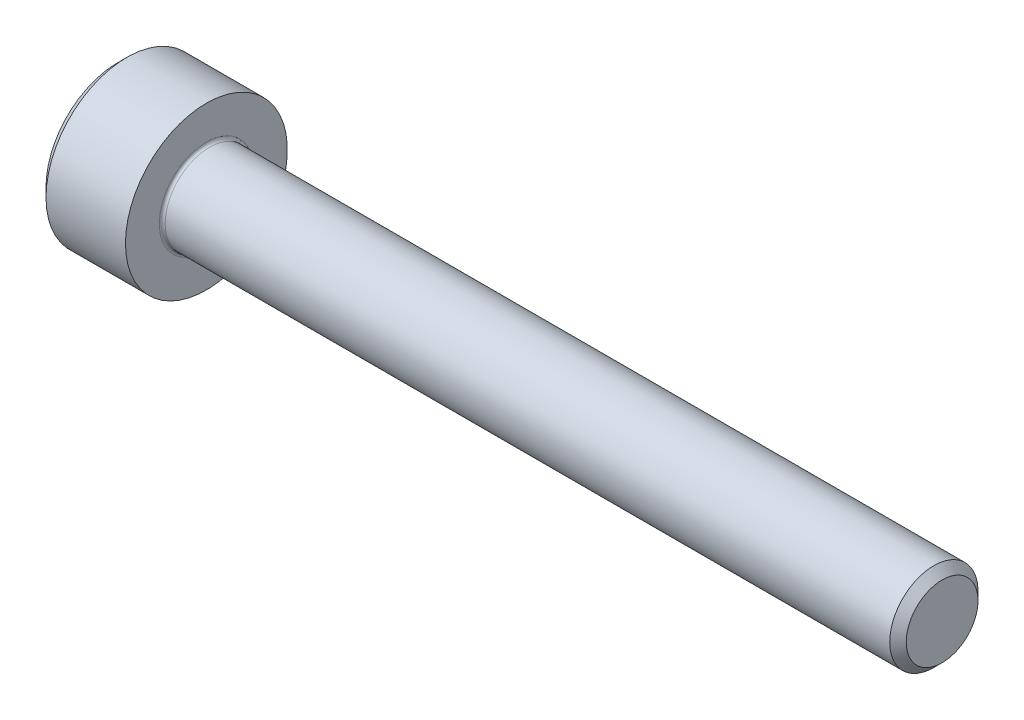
from build123d import *

# Parameters (mm, degrees)
FILLET1_R   = 0.1
HEX_2_DEPTH = 1.3


with BuildPart() as part:
    # BodySke → Base-Revolve (revolve)
    with BuildSketch(Plane.XY, mode=Mode.PRIVATE) as base_revolve_sk:
        Polygon((0, 0), (0, 2.45), (0.3, 2.75), (3, 2.75), (3, 1.5), (27.7195, 1.5), (28, 1.2195), (28, 0), align=None)
    revolve(base_revolve_sk.sketch.rotate(Axis((-31.75, 0, 0), (1, 0, 0)), 90), axis=Axis((-31.75, 0, 0), (1, 0, 0)))

    # Fillet1
    fillet1_edges = [part.edges().sort_by_distance(p)[0] for p in [
        (3, 0, -1.5),
    ]]
    fillet(fillet1_edges, radius=FILLET1_R)

    # Sketch2 → Hex-PreBroach (revolve, cut)
    with BuildSketch(Plane.XY, mode=Mode.PRIVATE) as hex_prebroach_sk:
        Polygon((0, 1.28), (1.3, 1.28), (2.039008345, 0), (0, 0), align=None)
    revolve(hex_prebroach_sk.sketch.rotate(Axis((0, 0, 0), (1, 0, 0)), 90), axis=Axis((0, 0, 0), (1, 0, 0)), mode=Mode.SUBTRACT)

    # Sketch3 → Hex 2 (cut)
    with BuildSketch(Plane(origin=(0, 0, 0), x_dir=(0, 0.500000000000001, 0.866025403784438), z_dir=(-1, 0, 0))):
        Polygon((0.739008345, 1.28), (-0.739008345, 1.28), (-1.478016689, 0), (-0.739008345, -1.28), (0.739008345, -1.28), (1.478016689, 0), align=None)
    extrude(amount=-HEX_2_DEPTH, mode=Mode.SUBTRACT)


solid = part.part
